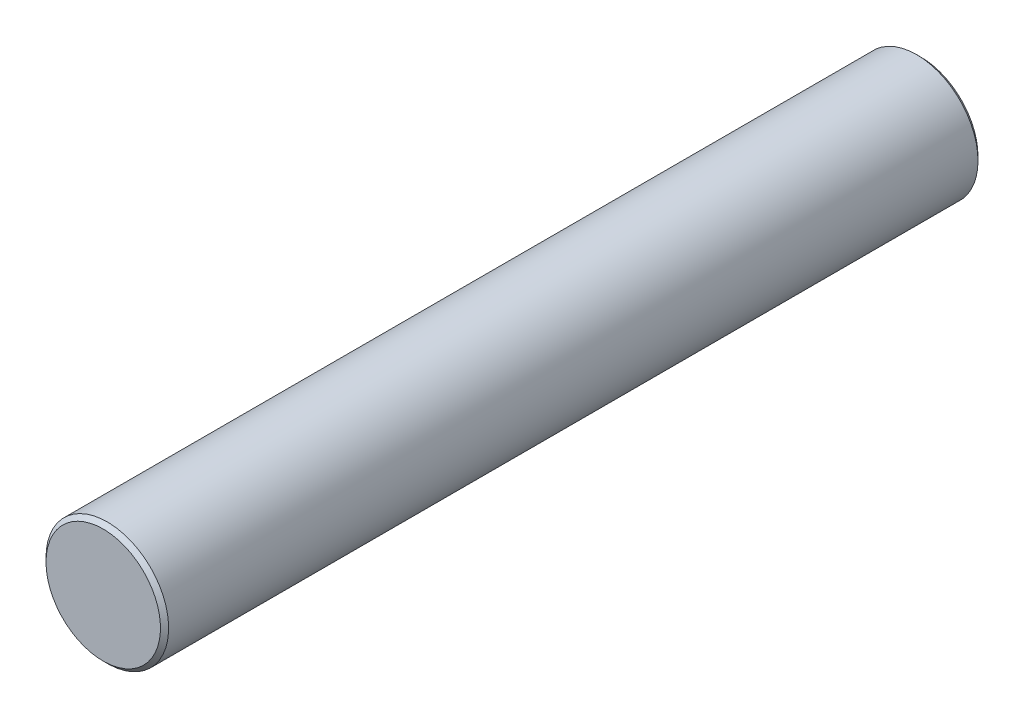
from build123d import *

# Parameters (mm, degrees)
ESQUISSE1_R            = 1.5
CYLINDRE_DE_BASE_DEPTH = 10
CHANFREIN1_SIZE        = 0.1


with BuildPart() as part:
    # Esquisse1 → Cylindre de base (new, symmetric)
    with BuildSketch(Plane.XY):
        with Locations(Location((0, 0, 0), (0, 0, 180))):
            Circle(ESQUISSE1_R)
    extrude(amount=CYLINDRE_DE_BASE_DEPTH, both=True)

    # Chanfrein1
    chanfrein1_edges = [part.edges().sort_by_distance(p)[0] for p in [
        (1.5, 0, -10),
        (1.5, 0, 10),
    ]]
    chamfer(chanfrein1_edges, length=CHANFREIN1_SIZE)


solid = part.part
